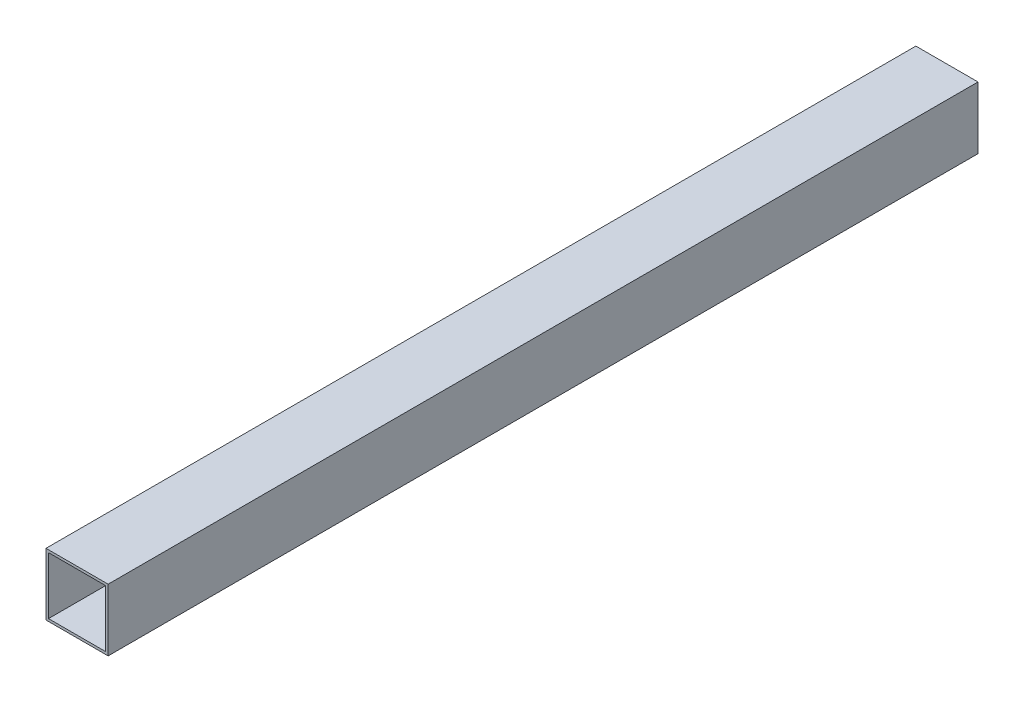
ISO-10303-21;
HEADER;
FILE_DESCRIPTION(('STEP AP214'),'2;1');
FILE_NAME('part.step','',(''),(''),'','','');
FILE_SCHEMA(('AUTOMOTIVE_DESIGN { 1 0 10303 214 1 1 1 1 }'));
ENDSEC;
DATA;
#1=APPLICATION_CONTEXT('core data for automotive mechanical design processes');
#2=APPLICATION_PROTOCOL_DEFINITION('international standard','automotive_design',2000,#1);
#3=PRODUCT_CONTEXT('',#1,'mechanical');
#4=PRODUCT('Part','Part','',(#3));
#5=PRODUCT_RELATED_PRODUCT_CATEGORY('part','',(#4));
#6=PRODUCT_DEFINITION_FORMATION('','',#4);
#7=PRODUCT_DEFINITION_CONTEXT('part definition',#1,'design');
#8=PRODUCT_DEFINITION('design','',#6,#7);
#9=PRODUCT_DEFINITION_SHAPE('','',#8);
#10=(LENGTH_UNIT() NAMED_UNIT(*) SI_UNIT(.MILLI.,.METRE.));
#11=(NAMED_UNIT(*) PLANE_ANGLE_UNIT() SI_UNIT($,.RADIAN.));
#12=(NAMED_UNIT(*) SI_UNIT($,.STERADIAN.) SOLID_ANGLE_UNIT());
#13=UNCERTAINTY_MEASURE_WITH_UNIT(LENGTH_MEASURE(1.E-05),#10,'distance_accuracy_value','');
#14=(GEOMETRIC_REPRESENTATION_CONTEXT(3) GLOBAL_UNCERTAINTY_ASSIGNED_CONTEXT((#13)) GLOBAL_UNIT_ASSIGNED_CONTEXT((#10,
#11,#12)) REPRESENTATION_CONTEXT('',''));
#15=CARTESIAN_POINT('',(0.,0.,0.));
#16=DIRECTION('',(0.,0.,1.));
#17=DIRECTION('',(1.,0.,0.));
#18=AXIS2_PLACEMENT_3D('',#15,#16,#17);
#19=CARTESIAN_POINT('',(0.,-1.52655665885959E-13,350.000000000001));
#20=DIRECTION('',(0.,0.,1.));
#21=DIRECTION('',(1.,0.,0.));
#22=AXIS2_PLACEMENT_3D('',#19,#20,#21);
#23=PLANE('',#22);
#24=DIRECTION('',(0.,1.,0.));
#25=VECTOR('',#24,1.);
#26=CARTESIAN_POINT('',(12.5,-12.5000000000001,350.));
#27=LINE('',#26,#25);
#28=CARTESIAN_POINT('',(12.5,-12.5000000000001,350.));
#29=VERTEX_POINT('',#28);
#30=CARTESIAN_POINT('',(12.4999999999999,12.4999999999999,350.));
#31=VERTEX_POINT('',#30);
#32=EDGE_CURVE('E163',#29,#31,#27,.T.);
#33=ORIENTED_EDGE('',*,*,#32,.T.);
#34=DIRECTION('',(-1.,0.,0.));
#35=VECTOR('',#34,1.);
#36=CARTESIAN_POINT('',(-12.5,12.4999999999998,350.));
#37=LINE('',#36,#35);
#38=CARTESIAN_POINT('',(-12.5,12.4999999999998,350.));
#39=VERTEX_POINT('',#38);
#40=EDGE_CURVE('E166',#31,#39,#37,.T.);
#41=ORIENTED_EDGE('',*,*,#40,.T.);
#42=DIRECTION('',(0.,-1.,0.));
#43=VECTOR('',#42,1.);
#44=CARTESIAN_POINT('',(-12.5,-12.5000000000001,350.));
#45=LINE('',#44,#43);
#46=CARTESIAN_POINT('',(-12.5,-12.5000000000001,350.));
#47=VERTEX_POINT('',#46);
#48=EDGE_CURVE('E169',#39,#47,#45,.T.);
#49=ORIENTED_EDGE('',*,*,#48,.T.);
#50=DIRECTION('',(1.,0.,0.));
#51=VECTOR('',#50,1.);
#52=CARTESIAN_POINT('',(-12.5,-12.5000000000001,350.));
#53=LINE('',#52,#51);
#54=EDGE_CURVE('E171',#47,#29,#53,.T.);
#55=ORIENTED_EDGE('',*,*,#54,.T.);
#56=EDGE_LOOP('',(#33,#41,#49,#55));
#57=FACE_BOUND('',#56,.T.);
#58=DIRECTION('',(-1.,0.,0.));
#59=VECTOR('',#58,1.);
#60=CARTESIAN_POINT('',(0.,11.4999999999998,350.));
#61=LINE('',#60,#59);
#62=CARTESIAN_POINT('',(11.5,11.4999999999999,350.));
#63=VERTEX_POINT('',#62);
#64=CARTESIAN_POINT('',(-11.5000000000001,11.5,350.));
#65=VERTEX_POINT('',#64);
#66=EDGE_CURVE('E135',#63,#65,#61,.T.);
#67=ORIENTED_EDGE('',*,*,#66,.F.);
#68=DIRECTION('',(0.,1.,0.));
#69=VECTOR('',#68,1.);
#70=CARTESIAN_POINT('',(11.5,-1.66533453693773E-13,350.));
#71=LINE('',#70,#69);
#72=CARTESIAN_POINT('',(11.5,-11.5000000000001,350.));
#73=VERTEX_POINT('',#72);
#74=EDGE_CURVE('E127',#73,#63,#71,.T.);
#75=ORIENTED_EDGE('',*,*,#74,.F.);
#76=DIRECTION('',(1.,0.,0.));
#77=VECTOR('',#76,1.);
#78=CARTESIAN_POINT('',(0.,-11.5000000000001,350.));
#79=LINE('',#78,#77);
#80=CARTESIAN_POINT('',(-11.5000000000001,-11.5000000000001,350.000000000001));
#81=VERTEX_POINT('',#80);
#82=EDGE_CURVE('E149',#81,#73,#79,.T.);
#83=ORIENTED_EDGE('',*,*,#82,.F.);
#84=DIRECTION('',(0.,-1.,0.));
#85=VECTOR('',#84,1.);
#86=CARTESIAN_POINT('',(-11.5,-1.80411241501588E-13,350.));
#87=LINE('',#86,#85);
#88=EDGE_CURVE('E147',#65,#81,#87,.T.);
#89=ORIENTED_EDGE('',*,*,#88,.F.);
#90=EDGE_LOOP('',(#67,#75,#83,#89));
#91=FACE_BOUND('',#90,.T.);
#92=ADVANCED_FACE('F62',(#57,#91),#23,.T.);
#93=CARTESIAN_POINT('',(0.,0.,0.));
#94=DIRECTION('',(0.,0.,1.));
#95=DIRECTION('',(1.,0.,0.));
#96=AXIS2_PLACEMENT_3D('',#93,#94,#95);
#97=PLANE('',#96);
#98=DIRECTION('',(0.,1.,0.));
#99=VECTOR('',#98,1.);
#100=CARTESIAN_POINT('',(12.5,-12.5000000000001,-2.22044604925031E-13));
#101=LINE('',#100,#99);
#102=CARTESIAN_POINT('',(12.5,-12.5000000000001,-2.22044604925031E-13));
#103=VERTEX_POINT('',#102);
#104=CARTESIAN_POINT('',(12.5,12.4999999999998,-2.22044604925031E-13));
#105=VERTEX_POINT('',#104);
#106=EDGE_CURVE('E143',#103,#105,#101,.T.);
#107=ORIENTED_EDGE('',*,*,#106,.F.);
#108=DIRECTION('',(1.,0.,0.));
#109=VECTOR('',#108,1.);
#110=CARTESIAN_POINT('',(-12.5,-12.5000000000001,-2.22044604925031E-13));
#111=LINE('',#110,#109);
#112=CARTESIAN_POINT('',(-12.5,-12.5000000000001,-2.22044604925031E-13));
#113=VERTEX_POINT('',#112);
#114=EDGE_CURVE('E167',#113,#103,#111,.T.);
#115=ORIENTED_EDGE('',*,*,#114,.F.);
#116=DIRECTION('',(0.,-1.,0.));
#117=VECTOR('',#116,1.);
#118=CARTESIAN_POINT('',(-12.5,-12.5000000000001,-2.22044604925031E-13));
#119=LINE('',#118,#117);
#120=CARTESIAN_POINT('',(-12.5000000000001,12.5,-2.22044604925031E-13));
#121=VERTEX_POINT('',#120);
#122=EDGE_CURVE('E178',#121,#113,#119,.T.);
#123=ORIENTED_EDGE('',*,*,#122,.F.);
#124=DIRECTION('',(-1.,0.,0.));
#125=VECTOR('',#124,1.);
#126=CARTESIAN_POINT('',(-12.5000000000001,12.5,-2.22044604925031E-13));
#127=LINE('',#126,#125);
#128=EDGE_CURVE('E176',#105,#121,#127,.T.);
#129=ORIENTED_EDGE('',*,*,#128,.F.);
#130=EDGE_LOOP('',(#107,#115,#123,#129));
#131=FACE_BOUND('',#130,.T.);
#132=DIRECTION('',(0.,1.,0.));
#133=VECTOR('',#132,1.);
#134=CARTESIAN_POINT('',(11.4999999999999,-1.2490009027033E-13,-2.22044604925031E-13));
#135=LINE('',#134,#133);
#136=CARTESIAN_POINT('',(11.5,-11.5000000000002,-2.22044604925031E-13));
#137=VERTEX_POINT('',#136);
#138=CARTESIAN_POINT('',(11.5,11.4999999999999,-2.22044604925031E-13));
#139=VERTEX_POINT('',#138);
#140=EDGE_CURVE('E85',#137,#139,#135,.T.);
#141=ORIENTED_EDGE('',*,*,#140,.T.);
#142=DIRECTION('',(-1.,0.,0.));
#143=VECTOR('',#142,1.);
#144=CARTESIAN_POINT('',(0.,11.4999999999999,0.));
#145=LINE('',#144,#143);
#146=CARTESIAN_POINT('',(-11.5,11.4999999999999,0.));
#147=VERTEX_POINT('',#146);
#148=EDGE_CURVE('E142',#139,#147,#145,.T.);
#149=ORIENTED_EDGE('',*,*,#148,.T.);
#150=DIRECTION('',(0.,-1.,0.));
#151=VECTOR('',#150,1.);
#152=CARTESIAN_POINT('',(-11.5,0.,0.));
#153=LINE('',#152,#151);
#154=CARTESIAN_POINT('',(-11.5,-11.5000000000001,6.66133814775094E-13));
#155=VERTEX_POINT('',#154);
#156=EDGE_CURVE('E155',#147,#155,#153,.T.);
#157=ORIENTED_EDGE('',*,*,#156,.T.);
#158=DIRECTION('',(1.,0.,0.));
#159=VECTOR('',#158,1.);
#160=CARTESIAN_POINT('',(0.,-11.5000000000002,0.));
#161=LINE('',#160,#159);
#162=EDGE_CURVE('E136',#155,#137,#161,.T.);
#163=ORIENTED_EDGE('',*,*,#162,.T.);
#164=EDGE_LOOP('',(#141,#149,#157,#163));
#165=FACE_BOUND('',#164,.T.);
#166=ADVANCED_FACE('F196',(#131,#165),#97,.F.);
#167=CARTESIAN_POINT('',(12.5,-12.5000000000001,350.));
#168=DIRECTION('',(-1.,0.,0.));
#169=DIRECTION('',(0.,0.,1.));
#170=AXIS2_PLACEMENT_3D('',#167,#168,#169);
#171=PLANE('',#170);
#172=ORIENTED_EDGE('',*,*,#106,.T.);
#173=DIRECTION('',(0.,0.,-1.));
#174=VECTOR('',#173,1.);
#175=CARTESIAN_POINT('',(12.4999999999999,12.4999999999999,350.));
#176=LINE('',#175,#174);
#177=EDGE_CURVE('E12',#31,#105,#176,.T.);
#178=ORIENTED_EDGE('',*,*,#177,.F.);
#179=ORIENTED_EDGE('',*,*,#32,.F.);
#180=DIRECTION('',(0.,0.,-1.));
#181=VECTOR('',#180,1.);
#182=CARTESIAN_POINT('',(12.5,-12.5000000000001,350.));
#183=LINE('',#182,#181);
#184=EDGE_CURVE('E173',#29,#103,#183,.T.);
#185=ORIENTED_EDGE('',*,*,#184,.T.);
#186=EDGE_LOOP('',(#172,#178,#179,#185));
#187=FACE_BOUND('',#186,.T.);
#188=ADVANCED_FACE('F64',(#187),#171,.F.);
#189=CARTESIAN_POINT('',(-12.5,12.4999999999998,350.));
#190=DIRECTION('',(0.,-1.,0.));
#191=DIRECTION('',(0.,0.,-1.));
#192=AXIS2_PLACEMENT_3D('',#189,#190,#191);
#193=PLANE('',#192);
#194=ORIENTED_EDGE('',*,*,#128,.T.);
#195=DIRECTION('',(0.,0.,-1.));
#196=VECTOR('',#195,1.);
#197=CARTESIAN_POINT('',(-12.5,12.4999999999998,350.));
#198=LINE('',#197,#196);
#199=EDGE_CURVE('E70',#39,#121,#198,.T.);
#200=ORIENTED_EDGE('',*,*,#199,.F.);
#201=ORIENTED_EDGE('',*,*,#40,.F.);
#202=ORIENTED_EDGE('',*,*,#177,.T.);
#203=EDGE_LOOP('',(#194,#200,#201,#202));
#204=FACE_BOUND('',#203,.T.);
#205=ADVANCED_FACE('F206',(#204),#193,.F.);
#206=CARTESIAN_POINT('',(-12.5,-12.5000000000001,350.));
#207=DIRECTION('',(1.,0.,0.));
#208=DIRECTION('',(0.,0.,-1.));
#209=AXIS2_PLACEMENT_3D('',#206,#207,#208);
#210=PLANE('',#209);
#211=ORIENTED_EDGE('',*,*,#122,.T.);
#212=DIRECTION('',(0.,0.,-1.));
#213=VECTOR('',#212,1.);
#214=CARTESIAN_POINT('',(-12.5,-12.5000000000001,350.));
#215=LINE('',#214,#213);
#216=EDGE_CURVE('E183',#47,#113,#215,.T.);
#217=ORIENTED_EDGE('',*,*,#216,.F.);
#218=ORIENTED_EDGE('',*,*,#48,.F.);
#219=ORIENTED_EDGE('',*,*,#199,.T.);
#220=EDGE_LOOP('',(#211,#217,#218,#219));
#221=FACE_BOUND('',#220,.T.);
#222=ADVANCED_FACE('F190',(#221),#210,.F.);
#223=CARTESIAN_POINT('',(-12.5,-12.5000000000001,350.));
#224=DIRECTION('',(0.,1.,0.));
#225=DIRECTION('',(0.,0.,1.));
#226=AXIS2_PLACEMENT_3D('',#223,#224,#225);
#227=PLANE('',#226);
#228=ORIENTED_EDGE('',*,*,#114,.T.);
#229=ORIENTED_EDGE('',*,*,#184,.F.);
#230=ORIENTED_EDGE('',*,*,#54,.F.);
#231=ORIENTED_EDGE('',*,*,#216,.T.);
#232=EDGE_LOOP('',(#228,#229,#230,#231));
#233=FACE_BOUND('',#232,.T.);
#234=ADVANCED_FACE('F200',(#233),#227,.F.);
#235=CARTESIAN_POINT('',(11.5,-1.66533453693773E-13,350.));
#236=DIRECTION('',(-1.,0.,0.));
#237=DIRECTION('',(0.,0.,1.));
#238=AXIS2_PLACEMENT_3D('',#235,#236,#237);
#239=PLANE('',#238);
#240=ORIENTED_EDGE('',*,*,#140,.F.);
#241=DIRECTION('',(0.,0.,-1.));
#242=VECTOR('',#241,1.);
#243=CARTESIAN_POINT('',(11.5,-11.5000000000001,350.));
#244=LINE('',#243,#242);
#245=EDGE_CURVE('E131',#73,#137,#244,.T.);
#246=ORIENTED_EDGE('',*,*,#245,.F.);
#247=ORIENTED_EDGE('',*,*,#74,.T.);
#248=DIRECTION('',(0.,0.,-1.));
#249=VECTOR('',#248,1.);
#250=CARTESIAN_POINT('',(11.5,11.4999999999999,350.));
#251=LINE('',#250,#249);
#252=EDGE_CURVE('E130',#63,#139,#251,.T.);
#253=ORIENTED_EDGE('',*,*,#252,.T.);
#254=EDGE_LOOP('',(#240,#246,#247,#253));
#255=FACE_BOUND('',#254,.T.);
#256=ADVANCED_FACE('F129',(#255),#239,.T.);
#257=CARTESIAN_POINT('',(0.,11.4999999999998,350.));
#258=DIRECTION('',(0.,-1.,0.));
#259=DIRECTION('',(0.,0.,-1.));
#260=AXIS2_PLACEMENT_3D('',#257,#258,#259);
#261=PLANE('',#260);
#262=ORIENTED_EDGE('',*,*,#148,.F.);
#263=ORIENTED_EDGE('',*,*,#252,.F.);
#264=ORIENTED_EDGE('',*,*,#66,.T.);
#265=DIRECTION('',(0.,0.,-1.));
#266=VECTOR('',#265,1.);
#267=CARTESIAN_POINT('',(-11.5000000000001,11.5,350.));
#268=LINE('',#267,#266);
#269=EDGE_CURVE('E144',#65,#147,#268,.T.);
#270=ORIENTED_EDGE('',*,*,#269,.T.);
#271=EDGE_LOOP('',(#262,#263,#264,#270));
#272=FACE_BOUND('',#271,.T.);
#273=ADVANCED_FACE('F139',(#272),#261,.T.);
#274=CARTESIAN_POINT('',(-11.5,-1.80411241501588E-13,350.));
#275=DIRECTION('',(1.,0.,0.));
#276=DIRECTION('',(0.,0.,-1.));
#277=AXIS2_PLACEMENT_3D('',#274,#275,#276);
#278=PLANE('',#277);
#279=ORIENTED_EDGE('',*,*,#156,.F.);
#280=ORIENTED_EDGE('',*,*,#269,.F.);
#281=ORIENTED_EDGE('',*,*,#88,.T.);
#282=DIRECTION('',(0.,0.,-1.));
#283=VECTOR('',#282,1.);
#284=CARTESIAN_POINT('',(-11.5000000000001,-11.5000000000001,350.000000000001));
#285=LINE('',#284,#283);
#286=EDGE_CURVE('E77',#81,#155,#285,.T.);
#287=ORIENTED_EDGE('',*,*,#286,.T.);
#288=EDGE_LOOP('',(#279,#280,#281,#287));
#289=FACE_BOUND('',#288,.T.);
#290=ADVANCED_FACE('F229',(#289),#278,.T.);
#291=CARTESIAN_POINT('',(0.,-11.5000000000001,350.));
#292=DIRECTION('',(0.,1.,0.));
#293=DIRECTION('',(0.,0.,1.));
#294=AXIS2_PLACEMENT_3D('',#291,#292,#293);
#295=PLANE('',#294);
#296=ORIENTED_EDGE('',*,*,#162,.F.);
#297=ORIENTED_EDGE('',*,*,#286,.F.);
#298=ORIENTED_EDGE('',*,*,#82,.T.);
#299=ORIENTED_EDGE('',*,*,#245,.T.);
#300=EDGE_LOOP('',(#296,#297,#298,#299));
#301=FACE_BOUND('',#300,.T.);
#302=ADVANCED_FACE('F233',(#301),#295,.T.);
#303=CLOSED_SHELL('',(#92,#166,#188,#205,#222,#234,#256,#273,#290,#302));
#304=MANIFOLD_SOLID_BREP('B2',#303);
#305=ADVANCED_BREP_SHAPE_REPRESENTATION('',(#18,#304),#14);
#306=SHAPE_DEFINITION_REPRESENTATION(#9,#305);
ENDSEC;
END-ISO-10303-21;
